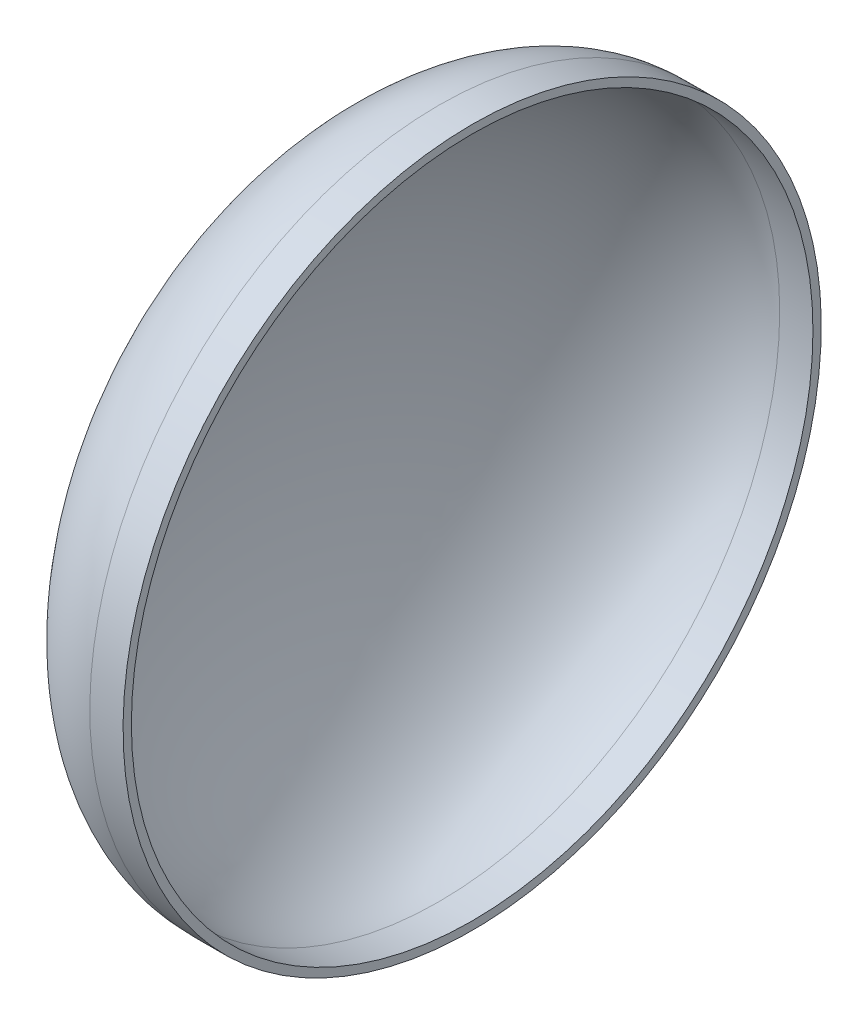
from build123d import *


with BuildPart() as part:
    # Sketch1 → Revolve1 (revolve)
    with BuildSketch(Plane.XY):
        with BuildLine():
            Line((-1828.8, 533.4), (-1828.8, 520.7))
            Line((-1828.8, 520.7), (-1879.6, 520.7))
            add(Edge.make_bspline(
                [(-1879.6, 520.7), (-1883.666235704, 520.7), (-1891.78356429, 520.3106341), (-1908.027304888, 517.971460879), (-1928.297729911, 512.10771747), (-1952.453420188, 500.303799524), (-1984.136113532, 478.184705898), (-2022.053710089, 438.687396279), (-2062.534499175, 373.859954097), (-2096.032039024, 294.175191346), (-2116.867805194, 218.050214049), (-2128.756111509, 153.141666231), (-2135.193453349, 102.944785), (-2138.434393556, 60.263439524), (-2139.733302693, 25.86538255), (-2139.95, 8.618485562), (-2139.95, 0)],
                knots=[0, 0, 0, 0, 0.049087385, 0.09817477, 0.196349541, 0.294524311, 0.392699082, 0.589048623, 0.785398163, 0.981747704, 1.178097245, 1.276272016, 1.374446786, 1.472621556, 1.521708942, 1.570796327, 1.570796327, 1.570796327, 1.570796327], degree=3))
            Line((-2139.95, 0), (-2152.65, 0))
            add(Edge.make_bspline(
                [(-1879.6, 533.4), (-2152.65, 533.4), (-2152.65, 0)],
                knots=[0, 0, 0, 1.570796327, 1.570796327, 1.570796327], degree=2, weights=[1, 0.707106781, 1]))
            Line((-1879.6, 533.4), (-1828.8, 533.4))
        make_face()
    revolve(axis=Axis((-1879.6, 0, 0), (-1, 0, 0)))


solid = part.part
